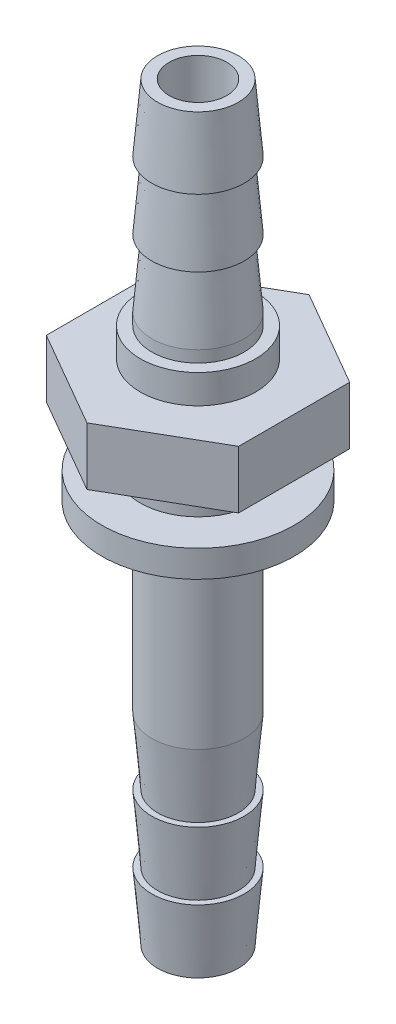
from build123d import *

# Parameters (mm, degrees)
ESQUISSE2_R        = 1.5
BOSS_EXTRU_1_DEPTH = 3


with BuildPart() as part:
    # Esquisse1 → R_volution1 (revolve)
    with BuildSketch(Plane(origin=(0, 0, 0), x_dir=(0, 0, -1), z_dir=(1, 0, 0)), mode=Mode.PRIVATE) as r_volution1_sk:
        Polygon((-2.4, 0), (-5, 0), (-5, 1.4), (-3, 1.4), (-3, 7.9), (-2.4, 7.9), (-2.4, 8.5), (-2.1, 12), (-2.4, 12), (-2.1, 15.5), (-2.4, 15.5), (-2.1, 19), (-1.5, 19), (-1.5, -20), (-2.1, -20), (-2.4, -16.5), (-2.1, -16.5), (-2.4, -13), (-2.1, -13), (-2.4, -9.5), align=None)
    revolve(r_volution1_sk.sketch.rotate(Axis((0, 0, 0), (0, 1, 0)), 180), axis=Axis((0, 0, 0), (0, 1, 0)))

    # Esquisse2 → Boss.-Extru.1 (add)
    with BuildSketch(Plane(origin=(0, 3.4, 0), x_dir=(1, 0, 0), z_dir=(0, 1, 0))):
        Polygon((5, -2.886751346), (5, 2.886751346), (0, 5.773502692), (-5, 2.886751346), (-5, -2.886751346), (0, -5.773502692), align=None)
        with Locations(Location((0, 0, 0), (0, 0, 90))):
            Circle(ESQUISSE2_R, mode=Mode.SUBTRACT)
    extrude(amount=BOSS_EXTRU_1_DEPTH)


solid = part.part
